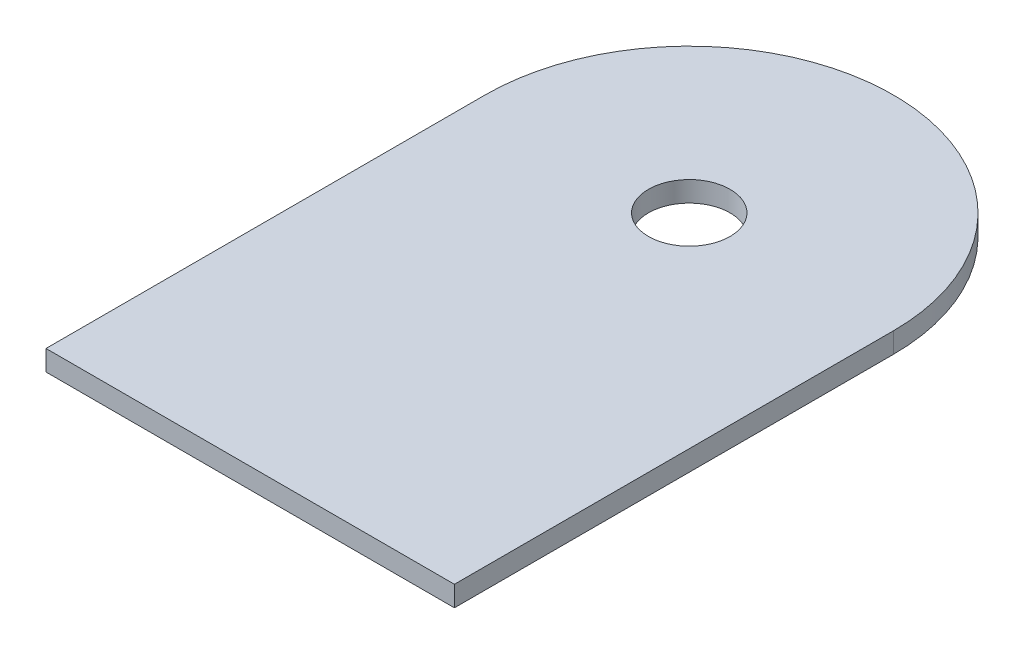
ISO-10303-21;
HEADER;
FILE_DESCRIPTION(('STEP AP214'),'2;1');
FILE_NAME('part.step','',(''),(''),'','','');
FILE_SCHEMA(('AUTOMOTIVE_DESIGN { 1 0 10303 214 1 1 1 1 }'));
ENDSEC;
DATA;
#1=APPLICATION_CONTEXT('core data for automotive mechanical design processes');
#2=APPLICATION_PROTOCOL_DEFINITION('international standard','automotive_design',2000,#1);
#3=PRODUCT_CONTEXT('',#1,'mechanical');
#4=PRODUCT('Part','Part','',(#3));
#5=PRODUCT_RELATED_PRODUCT_CATEGORY('part','',(#4));
#6=PRODUCT_DEFINITION_FORMATION('','',#4);
#7=PRODUCT_DEFINITION_CONTEXT('part definition',#1,'design');
#8=PRODUCT_DEFINITION('design','',#6,#7);
#9=PRODUCT_DEFINITION_SHAPE('','',#8);
#10=(LENGTH_UNIT() NAMED_UNIT(*) SI_UNIT(.MILLI.,.METRE.));
#11=(NAMED_UNIT(*) PLANE_ANGLE_UNIT() SI_UNIT($,.RADIAN.));
#12=(NAMED_UNIT(*) SI_UNIT($,.STERADIAN.) SOLID_ANGLE_UNIT());
#13=UNCERTAINTY_MEASURE_WITH_UNIT(LENGTH_MEASURE(1.E-05),#10,'distance_accuracy_value','');
#14=(GEOMETRIC_REPRESENTATION_CONTEXT(3) GLOBAL_UNCERTAINTY_ASSIGNED_CONTEXT((#13)) GLOBAL_UNIT_ASSIGNED_CONTEXT((#10,
#11,#12)) REPRESENTATION_CONTEXT('',''));
#15=CARTESIAN_POINT('',(0.,0.,0.));
#16=DIRECTION('',(0.,0.,1.));
#17=DIRECTION('',(1.,0.,0.));
#18=AXIS2_PLACEMENT_3D('',#15,#16,#17);
#19=CARTESIAN_POINT('',(0.,2.,0.));
#20=DIRECTION('',(0.,1.,0.));
#21=DIRECTION('',(0.,0.,1.));
#22=AXIS2_PLACEMENT_3D('',#19,#20,#21);
#23=PLANE('',#22);
#24=CARTESIAN_POINT('',(0.,2.,0.));
#25=DIRECTION('',(0.,1.,0.));
#26=DIRECTION('',(0.,0.,1.));
#27=AXIS2_PLACEMENT_3D('',#24,#25,#26);
#28=CIRCLE('',#27,20.);
#29=CARTESIAN_POINT('',(20.,2.,0.));
#30=VERTEX_POINT('',#29);
#31=CARTESIAN_POINT('',(-20.,2.,0.));
#32=VERTEX_POINT('',#31);
#33=EDGE_CURVE('E98',#30,#32,#28,.T.);
#34=ORIENTED_EDGE('',*,*,#33,.T.);
#35=DIRECTION('',(0.,0.,1.));
#36=VECTOR('',#35,1.);
#37=CARTESIAN_POINT('',(-20.,2.,0.));
#38=LINE('',#37,#36);
#39=CARTESIAN_POINT('',(-20.,2.,43.));
#40=VERTEX_POINT('',#39);
#41=EDGE_CURVE('E93',#32,#40,#38,.T.);
#42=ORIENTED_EDGE('',*,*,#41,.T.);
#43=DIRECTION('',(1.,0.,0.));
#44=VECTOR('',#43,1.);
#45=CARTESIAN_POINT('',(20.,2.,43.));
#46=LINE('',#45,#44);
#47=CARTESIAN_POINT('',(20.,2.,43.));
#48=VERTEX_POINT('',#47);
#49=EDGE_CURVE('E96',#40,#48,#46,.T.);
#50=ORIENTED_EDGE('',*,*,#49,.T.);
#51=DIRECTION('',(0.,0.,-1.));
#52=VECTOR('',#51,1.);
#53=CARTESIAN_POINT('',(20.,2.,0.));
#54=LINE('',#53,#52);
#55=EDGE_CURVE('E63',#48,#30,#54,.T.);
#56=ORIENTED_EDGE('',*,*,#55,.T.);
#57=EDGE_LOOP('',(#34,#42,#50,#56));
#58=FACE_BOUND('',#57,.T.);
#59=CARTESIAN_POINT('',(0.,2.,0.));
#60=DIRECTION('',(0.,1.,0.));
#61=DIRECTION('',(0.,0.,1.));
#62=AXIS2_PLACEMENT_3D('',#59,#60,#61);
#63=CIRCLE('',#62,4.);
#64=CARTESIAN_POINT('',(0.,2.,4.));
#65=VERTEX_POINT('',#64);
#66=EDGE_CURVE('E118',#65,#65,#63,.T.);
#67=ORIENTED_EDGE('',*,*,#66,.F.);
#68=EDGE_LOOP('',(#67));
#69=FACE_BOUND('',#68,.T.);
#70=ADVANCED_FACE('F45',(#58,#69),#23,.T.);
#71=CARTESIAN_POINT('',(0.,0.,0.));
#72=DIRECTION('',(0.,1.,0.));
#73=DIRECTION('',(0.,0.,1.));
#74=AXIS2_PLACEMENT_3D('',#71,#72,#73);
#75=PLANE('',#74);
#76=CARTESIAN_POINT('',(0.,0.,0.));
#77=DIRECTION('',(0.,1.,0.));
#78=DIRECTION('',(0.,0.,1.));
#79=AXIS2_PLACEMENT_3D('',#76,#77,#78);
#80=CIRCLE('',#79,20.);
#81=CARTESIAN_POINT('',(20.,0.,0.));
#82=VERTEX_POINT('',#81);
#83=CARTESIAN_POINT('',(-20.,0.,0.));
#84=VERTEX_POINT('',#83);
#85=EDGE_CURVE('E114',#82,#84,#80,.T.);
#86=ORIENTED_EDGE('',*,*,#85,.F.);
#87=DIRECTION('',(0.,0.,-1.));
#88=VECTOR('',#87,1.);
#89=CARTESIAN_POINT('',(20.,0.,0.));
#90=LINE('',#89,#88);
#91=CARTESIAN_POINT('',(20.,0.,43.));
#92=VERTEX_POINT('',#91);
#93=EDGE_CURVE('E86',#92,#82,#90,.T.);
#94=ORIENTED_EDGE('',*,*,#93,.F.);
#95=DIRECTION('',(1.,0.,0.));
#96=VECTOR('',#95,1.);
#97=CARTESIAN_POINT('',(20.,0.,43.));
#98=LINE('',#97,#96);
#99=CARTESIAN_POINT('',(-20.,0.,43.));
#100=VERTEX_POINT('',#99);
#101=EDGE_CURVE('E80',#100,#92,#98,.T.);
#102=ORIENTED_EDGE('',*,*,#101,.F.);
#103=DIRECTION('',(0.,0.,1.));
#104=VECTOR('',#103,1.);
#105=CARTESIAN_POINT('',(-20.,0.,0.));
#106=LINE('',#105,#104);
#107=EDGE_CURVE('E103',#84,#100,#106,.T.);
#108=ORIENTED_EDGE('',*,*,#107,.F.);
#109=EDGE_LOOP('',(#86,#94,#102,#108));
#110=FACE_BOUND('',#109,.T.);
#111=CARTESIAN_POINT('',(0.,0.,0.));
#112=DIRECTION('',(0.,1.,0.));
#113=DIRECTION('',(0.,0.,1.));
#114=AXIS2_PLACEMENT_3D('',#111,#112,#113);
#115=CIRCLE('',#114,4.);
#116=CARTESIAN_POINT('',(0.,0.,4.));
#117=VERTEX_POINT('',#116);
#118=EDGE_CURVE('E136',#117,#117,#115,.T.);
#119=ORIENTED_EDGE('',*,*,#118,.T.);
#120=EDGE_LOOP('',(#119));
#121=FACE_BOUND('',#120,.T.);
#122=ADVANCED_FACE('F131',(#110,#121),#75,.F.);
#123=CARTESIAN_POINT('',(0.,2.,0.));
#124=DIRECTION('',(0.,-1.,0.));
#125=DIRECTION('',(0.,0.,-1.));
#126=AXIS2_PLACEMENT_3D('',#123,#124,#125);
#127=CYLINDRICAL_SURFACE('',#126,20.);
#128=ORIENTED_EDGE('',*,*,#85,.T.);
#129=DIRECTION('',(0.,-1.,0.));
#130=VECTOR('',#129,1.);
#131=CARTESIAN_POINT('',(-20.,2.,0.));
#132=LINE('',#131,#130);
#133=EDGE_CURVE('E11',#32,#84,#132,.T.);
#134=ORIENTED_EDGE('',*,*,#133,.F.);
#135=ORIENTED_EDGE('',*,*,#33,.F.);
#136=DIRECTION('',(0.,-1.,0.));
#137=VECTOR('',#136,1.);
#138=CARTESIAN_POINT('',(20.,2.,0.));
#139=LINE('',#138,#137);
#140=EDGE_CURVE('E110',#30,#82,#139,.T.);
#141=ORIENTED_EDGE('',*,*,#140,.T.);
#142=EDGE_LOOP('',(#128,#134,#135,#141));
#143=FACE_BOUND('',#142,.T.);
#144=ADVANCED_FACE('F47',(#143),#127,.T.);
#145=CARTESIAN_POINT('',(-20.,2.,0.));
#146=DIRECTION('',(1.,0.,0.));
#147=DIRECTION('',(0.,0.,-1.));
#148=AXIS2_PLACEMENT_3D('',#145,#146,#147);
#149=PLANE('',#148);
#150=ORIENTED_EDGE('',*,*,#107,.T.);
#151=DIRECTION('',(0.,-1.,0.));
#152=VECTOR('',#151,1.);
#153=CARTESIAN_POINT('',(-20.,2.,43.));
#154=LINE('',#153,#152);
#155=EDGE_CURVE('E55',#40,#100,#154,.T.);
#156=ORIENTED_EDGE('',*,*,#155,.F.);
#157=ORIENTED_EDGE('',*,*,#41,.F.);
#158=ORIENTED_EDGE('',*,*,#133,.T.);
#159=EDGE_LOOP('',(#150,#156,#157,#158));
#160=FACE_BOUND('',#159,.T.);
#161=ADVANCED_FACE('F102',(#160),#149,.F.);
#162=CARTESIAN_POINT('',(20.,2.,43.));
#163=DIRECTION('',(0.,0.,-1.));
#164=DIRECTION('',(-1.,0.,0.));
#165=AXIS2_PLACEMENT_3D('',#162,#163,#164);
#166=PLANE('',#165);
#167=ORIENTED_EDGE('',*,*,#101,.T.);
#168=DIRECTION('',(0.,-1.,0.));
#169=VECTOR('',#168,1.);
#170=CARTESIAN_POINT('',(20.,2.,43.));
#171=LINE('',#170,#169);
#172=EDGE_CURVE('E105',#48,#92,#171,.T.);
#173=ORIENTED_EDGE('',*,*,#172,.F.);
#174=ORIENTED_EDGE('',*,*,#49,.F.);
#175=ORIENTED_EDGE('',*,*,#155,.T.);
#176=EDGE_LOOP('',(#167,#173,#174,#175));
#177=FACE_BOUND('',#176,.T.);
#178=ADVANCED_FACE('F106',(#177),#166,.F.);
#179=CARTESIAN_POINT('',(20.,2.,0.));
#180=DIRECTION('',(-1.,0.,0.));
#181=DIRECTION('',(0.,0.,1.));
#182=AXIS2_PLACEMENT_3D('',#179,#180,#181);
#183=PLANE('',#182);
#184=ORIENTED_EDGE('',*,*,#93,.T.);
#185=ORIENTED_EDGE('',*,*,#140,.F.);
#186=ORIENTED_EDGE('',*,*,#55,.F.);
#187=ORIENTED_EDGE('',*,*,#172,.T.);
#188=EDGE_LOOP('',(#184,#185,#186,#187));
#189=FACE_BOUND('',#188,.T.);
#190=ADVANCED_FACE('F128',(#189),#183,.F.);
#191=CARTESIAN_POINT('',(0.,2.,0.));
#192=DIRECTION('',(0.,-1.,0.));
#193=DIRECTION('',(0.,0.,-1.));
#194=AXIS2_PLACEMENT_3D('',#191,#192,#193);
#195=CYLINDRICAL_SURFACE('',#194,4.);
#196=ORIENTED_EDGE('',*,*,#66,.T.);
#197=EDGE_LOOP('',(#196));
#198=FACE_BOUND('',#197,.T.);
#199=ORIENTED_EDGE('',*,*,#118,.F.);
#200=EDGE_LOOP('',(#199));
#201=FACE_BOUND('',#200,.T.);
#202=ADVANCED_FACE('F144',(#198,#201),#195,.F.);
#203=CLOSED_SHELL('',(#70,#122,#144,#161,#178,#190,#202));
#204=MANIFOLD_SOLID_BREP('B2',#203);
#205=ADVANCED_BREP_SHAPE_REPRESENTATION('',(#18,#204),#14);
#206=SHAPE_DEFINITION_REPRESENTATION(#9,#205);
ENDSEC;
END-ISO-10303-21;
